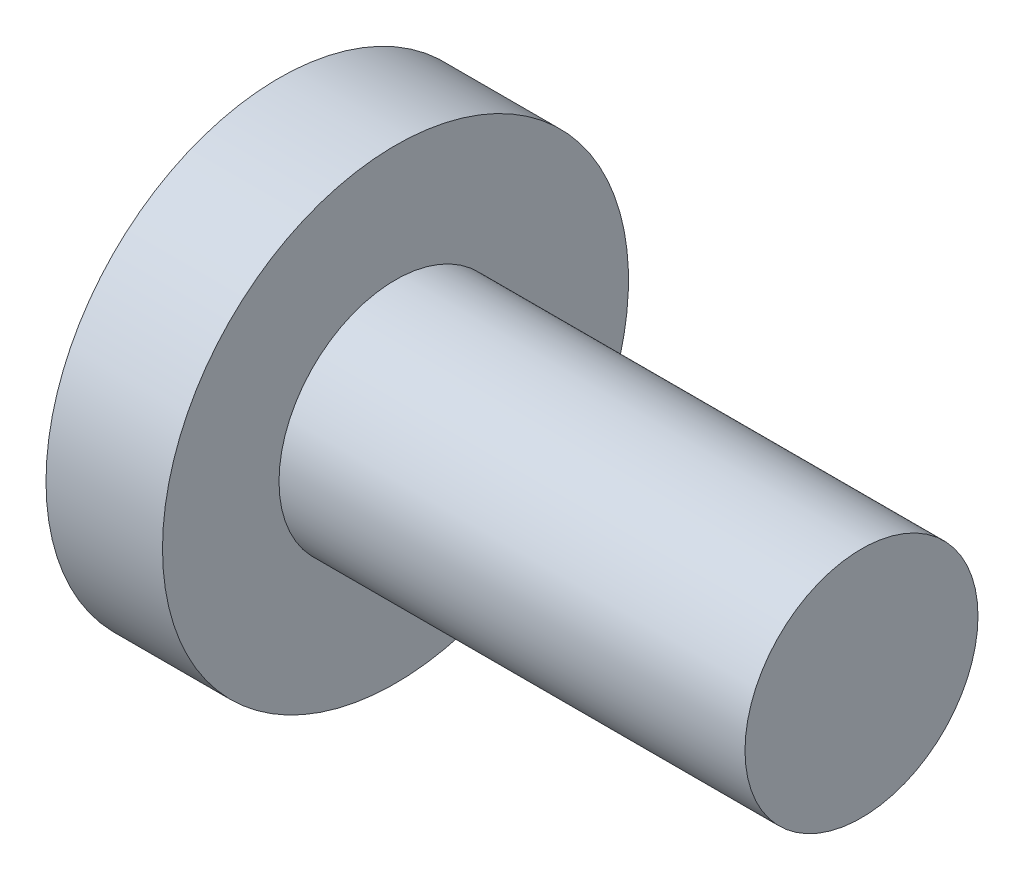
ISO-10303-21;
HEADER;
FILE_DESCRIPTION(('STEP AP214'),'2;1');
FILE_NAME('part.step','',(''),(''),'','','');
FILE_SCHEMA(('AUTOMOTIVE_DESIGN { 1 0 10303 214 1 1 1 1 }'));
ENDSEC;
DATA;
#1=APPLICATION_CONTEXT('core data for automotive mechanical design processes');
#2=APPLICATION_PROTOCOL_DEFINITION('international standard','automotive_design',2000,#1);
#3=PRODUCT_CONTEXT('',#1,'mechanical');
#4=PRODUCT('Part','Part','',(#3));
#5=PRODUCT_RELATED_PRODUCT_CATEGORY('part','',(#4));
#6=PRODUCT_DEFINITION_FORMATION('','',#4);
#7=PRODUCT_DEFINITION_CONTEXT('part definition',#1,'design');
#8=PRODUCT_DEFINITION('design','',#6,#7);
#9=PRODUCT_DEFINITION_SHAPE('','',#8);
#10=(LENGTH_UNIT() NAMED_UNIT(*) SI_UNIT(.MILLI.,.METRE.));
#11=(NAMED_UNIT(*) PLANE_ANGLE_UNIT() SI_UNIT($,.RADIAN.));
#12=(NAMED_UNIT(*) SI_UNIT($,.STERADIAN.) SOLID_ANGLE_UNIT());
#13=UNCERTAINTY_MEASURE_WITH_UNIT(LENGTH_MEASURE(1.E-05),#10,'distance_accuracy_value','');
#14=(GEOMETRIC_REPRESENTATION_CONTEXT(3) GLOBAL_UNCERTAINTY_ASSIGNED_CONTEXT((#13)) GLOBAL_UNIT_ASSIGNED_CONTEXT((#10,
#11,#12)) REPRESENTATION_CONTEXT('',''));
#15=CARTESIAN_POINT('',(0.,0.,0.));
#16=DIRECTION('',(0.,0.,1.));
#17=DIRECTION('',(1.,0.,0.));
#18=AXIS2_PLACEMENT_3D('',#15,#16,#17);
#19=CARTESIAN_POINT('',(0.,0.,0.));
#20=DIRECTION('',(1.,0.,0.));
#21=DIRECTION('',(0.,0.,-1.));
#22=AXIS2_PLACEMENT_3D('',#19,#20,#21);
#23=PLANE('',#22);
#24=CARTESIAN_POINT('',(0.,0.,0.));
#25=DIRECTION('',(-1.,0.,0.));
#26=DIRECTION('',(0.,0.,1.));
#27=AXIS2_PLACEMENT_3D('',#24,#25,#26);
#28=CIRCLE('',#27,10.);
#29=CARTESIAN_POINT('',(0.,0.,10.));
#30=VERTEX_POINT('',#29);
#31=EDGE_CURVE('E10',#30,#30,#28,.T.);
#32=ORIENTED_EDGE('',*,*,#31,.T.);
#33=EDGE_LOOP('',(#32));
#34=FACE_BOUND('',#33,.T.);
#35=ADVANCED_FACE('F32',(#34),#23,.F.);
#36=CARTESIAN_POINT('',(0.,0.,0.));
#37=DIRECTION('',(-1.,0.,0.));
#38=DIRECTION('',(0.,0.,1.));
#39=AXIS2_PLACEMENT_3D('',#36,#37,#38);
#40=CYLINDRICAL_SURFACE('',#39,10.);
#41=ORIENTED_EDGE('',*,*,#31,.F.);
#42=EDGE_LOOP('',(#41));
#43=FACE_BOUND('',#42,.T.);
#44=CARTESIAN_POINT('',(5.,0.,0.));
#45=DIRECTION('',(-1.,0.,0.));
#46=DIRECTION('',(0.,0.,1.));
#47=AXIS2_PLACEMENT_3D('',#44,#45,#46);
#48=CIRCLE('',#47,10.);
#49=CARTESIAN_POINT('',(5.,0.,10.));
#50=VERTEX_POINT('',#49);
#51=EDGE_CURVE('E38',#50,#50,#48,.T.);
#52=ORIENTED_EDGE('',*,*,#51,.T.);
#53=EDGE_LOOP('',(#52));
#54=FACE_BOUND('',#53,.T.);
#55=ADVANCED_FACE('F64',(#43,#54),#40,.T.);
#56=CARTESIAN_POINT('',(5.,10.,0.));
#57=DIRECTION('',(-1.,0.,0.));
#58=DIRECTION('',(0.,0.,1.));
#59=AXIS2_PLACEMENT_3D('',#56,#57,#58);
#60=PLANE('',#59);
#61=ORIENTED_EDGE('',*,*,#51,.F.);
#62=EDGE_LOOP('',(#61));
#63=FACE_BOUND('',#62,.T.);
#64=CARTESIAN_POINT('',(5.,0.,0.));
#65=DIRECTION('',(-1.,0.,0.));
#66=DIRECTION('',(0.,0.,1.));
#67=AXIS2_PLACEMENT_3D('',#64,#65,#66);
#68=CIRCLE('',#67,5.);
#69=CARTESIAN_POINT('',(5.,0.,5.));
#70=VERTEX_POINT('',#69);
#71=EDGE_CURVE('E42',#70,#70,#68,.T.);
#72=ORIENTED_EDGE('',*,*,#71,.T.);
#73=EDGE_LOOP('',(#72));
#74=FACE_BOUND('',#73,.T.);
#75=ADVANCED_FACE('F60',(#63,#74),#60,.F.);
#76=CARTESIAN_POINT('',(0.,0.,0.));
#77=DIRECTION('',(-1.,0.,0.));
#78=DIRECTION('',(0.,0.,1.));
#79=AXIS2_PLACEMENT_3D('',#76,#77,#78);
#80=CYLINDRICAL_SURFACE('',#79,5.);
#81=ORIENTED_EDGE('',*,*,#71,.F.);
#82=EDGE_LOOP('',(#81));
#83=FACE_BOUND('',#82,.T.);
#84=CARTESIAN_POINT('',(25.,0.,0.));
#85=DIRECTION('',(-1.,0.,0.));
#86=DIRECTION('',(0.,0.,1.));
#87=AXIS2_PLACEMENT_3D('',#84,#85,#86);
#88=CIRCLE('',#87,5.);
#89=CARTESIAN_POINT('',(25.,0.,5.));
#90=VERTEX_POINT('',#89);
#91=EDGE_CURVE('E46',#90,#90,#88,.T.);
#92=ORIENTED_EDGE('',*,*,#91,.T.);
#93=EDGE_LOOP('',(#92));
#94=FACE_BOUND('',#93,.T.);
#95=ADVANCED_FACE('F52',(#83,#94),#80,.T.);
#96=CARTESIAN_POINT('',(25.,5.,0.));
#97=DIRECTION('',(-1.,0.,0.));
#98=DIRECTION('',(0.,0.,1.));
#99=AXIS2_PLACEMENT_3D('',#96,#97,#98);
#100=PLANE('',#99);
#101=ORIENTED_EDGE('',*,*,#91,.F.);
#102=EDGE_LOOP('',(#101));
#103=FACE_BOUND('',#102,.T.);
#104=ADVANCED_FACE('F54',(#103),#100,.F.);
#105=CLOSED_SHELL('',(#35,#55,#75,#95,#104));
#106=MANIFOLD_SOLID_BREP('B2',#105);
#107=ADVANCED_BREP_SHAPE_REPRESENTATION('',(#18,#106),#14);
#108=SHAPE_DEFINITION_REPRESENTATION(#9,#107);
ENDSEC;
END-ISO-10303-21;
